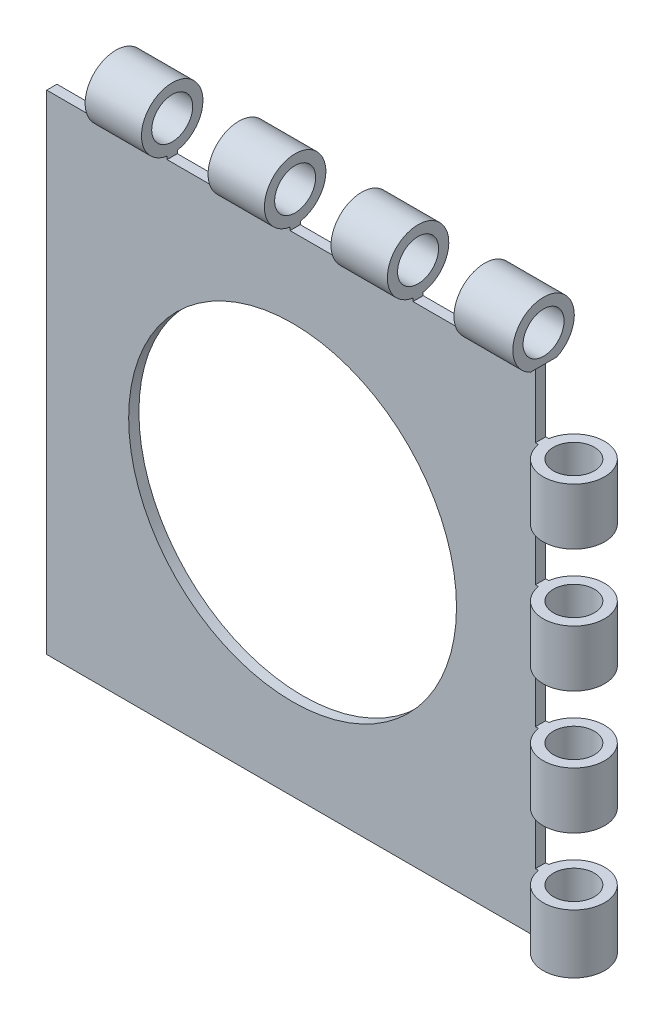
ISO-10303-21;
HEADER;
FILE_DESCRIPTION(('STEP AP214'),'2;1');
FILE_NAME('part.step','',(''),(''),'','','');
FILE_SCHEMA(('AUTOMOTIVE_DESIGN { 1 0 10303 214 1 1 1 1 }'));
ENDSEC;
DATA;
#1=APPLICATION_CONTEXT('core data for automotive mechanical design processes');
#2=APPLICATION_PROTOCOL_DEFINITION('international standard','automotive_design',2000,#1);
#3=PRODUCT_CONTEXT('',#1,'mechanical');
#4=PRODUCT('Part','Part','',(#3));
#5=PRODUCT_RELATED_PRODUCT_CATEGORY('part','',(#4));
#6=PRODUCT_DEFINITION_FORMATION('','',#4);
#7=PRODUCT_DEFINITION_CONTEXT('part definition',#1,'design');
#8=PRODUCT_DEFINITION('design','',#6,#7);
#9=PRODUCT_DEFINITION_SHAPE('','',#8);
#10=(LENGTH_UNIT() NAMED_UNIT(*) SI_UNIT(.MILLI.,.METRE.));
#11=(NAMED_UNIT(*) PLANE_ANGLE_UNIT() SI_UNIT($,.RADIAN.));
#12=(NAMED_UNIT(*) SI_UNIT($,.STERADIAN.) SOLID_ANGLE_UNIT());
#13=UNCERTAINTY_MEASURE_WITH_UNIT(LENGTH_MEASURE(1.E-05),#10,'distance_accuracy_value','');
#14=(GEOMETRIC_REPRESENTATION_CONTEXT(3) GLOBAL_UNCERTAINTY_ASSIGNED_CONTEXT((#13)) GLOBAL_UNIT_ASSIGNED_CONTEXT((#10,
#11,#12)) REPRESENTATION_CONTEXT('',''));
#15=CARTESIAN_POINT('',(0.,0.,0.));
#16=DIRECTION('',(0.,0.,1.));
#17=DIRECTION('',(1.,0.,0.));
#18=AXIS2_PLACEMENT_3D('',#15,#16,#17);
#19=CARTESIAN_POINT('',(76.2000000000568,80.8958883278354,0.79375000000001));
#20=DIRECTION('',(-1.,0.,0.));
#21=DIRECTION('',(0.,0.,1.));
#22=AXIS2_PLACEMENT_3D('',#19,#20,#21);
#23=CYLINDRICAL_SURFACE('',#22,4.7625);
#24=DIRECTION('',(-1.,0.,0.));
#25=VECTOR('',#24,1.);
#26=CARTESIAN_POINT('',(76.2,76.2,1.5875));
#27=LINE('',#26,#25);
#28=CARTESIAN_POINT('',(56.7531250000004,76.2,1.5875));
#29=VERTEX_POINT('',#28);
#30=CARTESIAN_POINT('',(48.0218750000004,76.2,1.5875));
#31=VERTEX_POINT('',#30);
#32=EDGE_CURVE('E345',#29,#31,#27,.T.);
#33=ORIENTED_EDGE('',*,*,#32,.F.);
#34=CARTESIAN_POINT('',(56.7531250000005,80.8958883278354,0.79375000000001));
#35=DIRECTION('',(1.,0.,0.));
#36=DIRECTION('',(0.,1.,0.));
#37=AXIS2_PLACEMENT_3D('',#34,#35,#36);
#38=CIRCLE('',#37,4.7625);
#39=CARTESIAN_POINT('',(56.7531250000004,76.2,0.));
#40=VERTEX_POINT('',#39);
#41=EDGE_CURVE('E542',#29,#40,#38,.F.);
#42=ORIENTED_EDGE('',*,*,#41,.T.);
#43=DIRECTION('',(-1.,0.,0.));
#44=VECTOR('',#43,1.);
#45=CARTESIAN_POINT('',(76.2,76.2,0.));
#46=LINE('',#45,#44);
#47=CARTESIAN_POINT('',(48.0218750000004,76.2,0.));
#48=VERTEX_POINT('',#47);
#49=EDGE_CURVE('E51',#40,#48,#46,.T.);
#50=ORIENTED_EDGE('',*,*,#49,.T.);
#51=CARTESIAN_POINT('',(48.0218750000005,80.8958883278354,0.79375000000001));
#52=DIRECTION('',(-1.,0.,0.));
#53=DIRECTION('',(0.,-1.,0.));
#54=AXIS2_PLACEMENT_3D('',#51,#52,#53);
#55=CIRCLE('',#54,4.7625);
#56=EDGE_CURVE('E528',#48,#31,#55,.F.);
#57=ORIENTED_EDGE('',*,*,#56,.T.);
#58=EDGE_LOOP('',(#33,#42,#50,#57));
#59=FACE_BOUND('',#58,.T.);
#60=ADVANCED_FACE('F28',(#59),#23,.T.);
#61=CARTESIAN_POINT('',(67.0718750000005,80.8958883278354,0.79375000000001));
#62=DIRECTION('',(-1.,0.,0.));
#63=DIRECTION('',(0.,-1.,0.));
#64=AXIS2_PLACEMENT_3D('',#61,#62,#63);
#65=CIRCLE('',#64,4.7625);
#66=CARTESIAN_POINT('',(67.0718750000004,76.2,0.));
#67=VERTEX_POINT('',#66);
#68=CARTESIAN_POINT('',(67.0718750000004,76.2,1.5875));
#69=VERTEX_POINT('',#68);
#70=EDGE_CURVE('E43',#67,#69,#65,.F.);
#71=ORIENTED_EDGE('',*,*,#70,.T.);
#72=CARTESIAN_POINT('',(75.7365133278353,76.2,1.5875));
#73=VERTEX_POINT('',#72);
#74=EDGE_CURVE('E342',#73,#69,#27,.T.);
#75=ORIENTED_EDGE('',*,*,#74,.F.);
#76=CARTESIAN_POINT('',(75.7365133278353,80.8958883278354,0.79375000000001));
#77=DIRECTION('',(-1.,0.,0.));
#78=DIRECTION('',(0.,0.,1.));
#79=AXIS2_PLACEMENT_3D('',#76,#77,#78);
#80=CIRCLE('',#79,4.7625);
#81=CARTESIAN_POINT('',(75.7365133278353,76.596875,2.84311347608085));
#82=VERTEX_POINT('',#81);
#83=EDGE_CURVE('E317',#82,#73,#80,.F.);
#84=ORIENTED_EDGE('',*,*,#83,.F.);
#85=DIRECTION('',(-1.,0.,0.));
#86=VECTOR('',#85,1.);
#87=CARTESIAN_POINT('',(76.2000000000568,76.596875,2.84311347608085));
#88=LINE('',#87,#86);
#89=CARTESIAN_POINT('',(76.2000000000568,76.596875,2.84311347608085));
#90=VERTEX_POINT('',#89);
#91=EDGE_CURVE('E382',#82,#90,#88,.F.);
#92=ORIENTED_EDGE('',*,*,#91,.T.);
#93=CARTESIAN_POINT('',(76.2000000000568,80.8958883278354,0.79375000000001));
#94=DIRECTION('',(-1.,0.,0.));
#95=DIRECTION('',(0.,0.,1.));
#96=AXIS2_PLACEMENT_3D('',#93,#94,#95);
#97=CIRCLE('',#96,4.7625);
#98=CARTESIAN_POINT('',(76.2000000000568,76.596875,-1.25561347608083));
#99=VERTEX_POINT('',#98);
#100=EDGE_CURVE('E367',#90,#99,#97,.T.);
#101=ORIENTED_EDGE('',*,*,#100,.T.);
#102=DIRECTION('',(-1.,0.,0.));
#103=VECTOR('',#102,1.);
#104=CARTESIAN_POINT('',(76.2000000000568,76.596875,-1.25561347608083));
#105=LINE('',#104,#103);
#106=CARTESIAN_POINT('',(75.7365133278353,76.596875,-1.25561347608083));
#107=VERTEX_POINT('',#106);
#108=EDGE_CURVE('E385',#99,#107,#105,.T.);
#109=ORIENTED_EDGE('',*,*,#108,.T.);
#110=CARTESIAN_POINT('',(75.7365133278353,76.2,0.));
#111=VERTEX_POINT('',#110);
#112=EDGE_CURVE('E318',#111,#107,#80,.F.);
#113=ORIENTED_EDGE('',*,*,#112,.F.);
#114=EDGE_CURVE('E358',#111,#67,#46,.T.);
#115=ORIENTED_EDGE('',*,*,#114,.T.);
#116=EDGE_LOOP('',(#71,#75,#84,#92,#101,#109,#113,#115));
#117=FACE_BOUND('',#116,.T.);
#118=ADVANCED_FACE('F559',(#117),#23,.T.);
#119=CARTESIAN_POINT('',(85.6583883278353,80.8958883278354,0.79375000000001));
#120=DIRECTION('',(-1.,0.,0.));
#121=DIRECTION('',(0.,0.,1.));
#122=AXIS2_PLACEMENT_3D('',#119,#120,#121);
#123=CYLINDRICAL_SURFACE('',#122,3.175);
#124=CARTESIAN_POINT('',(48.0218750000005,80.8958883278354,0.79375000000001));
#125=DIRECTION('',(-1.,0.,0.));
#126=DIRECTION('',(0.,-1.,0.));
#127=AXIS2_PLACEMENT_3D('',#124,#125,#126);
#128=CIRCLE('',#127,3.175);
#129=CARTESIAN_POINT('',(48.0218750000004,77.7208883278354,0.79375000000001));
#130=VERTEX_POINT('',#129);
#131=EDGE_CURVE('E522',#130,#130,#128,.F.);
#132=ORIENTED_EDGE('',*,*,#131,.F.);
#133=EDGE_LOOP('',(#132));
#134=FACE_BOUND('',#133,.T.);
#135=CARTESIAN_POINT('',(56.7531250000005,80.8958883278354,0.79375000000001));
#136=DIRECTION('',(1.,0.,0.));
#137=DIRECTION('',(0.,1.,0.));
#138=AXIS2_PLACEMENT_3D('',#135,#136,#137);
#139=CIRCLE('',#138,3.175);
#140=CARTESIAN_POINT('',(56.7531250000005,84.0708883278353,0.79375000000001));
#141=VERTEX_POINT('',#140);
#142=EDGE_CURVE('E537',#141,#141,#139,.F.);
#143=ORIENTED_EDGE('',*,*,#142,.F.);
#144=EDGE_LOOP('',(#143));
#145=FACE_BOUND('',#144,.T.);
#146=ADVANCED_FACE('F654',(#134,#145),#123,.F.);
#147=CARTESIAN_POINT('',(76.2000000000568,80.8958883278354,0.79375000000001));
#148=DIRECTION('',(-1.,0.,0.));
#149=DIRECTION('',(0.,0.,1.));
#150=AXIS2_PLACEMENT_3D('',#147,#148,#149);
#151=CIRCLE('',#150,3.175);
#152=CARTESIAN_POINT('',(76.2000000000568,80.8958883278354,3.96875000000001));
#153=VERTEX_POINT('',#152);
#154=EDGE_CURVE('E328',#153,#153,#151,.T.);
#155=ORIENTED_EDGE('',*,*,#154,.F.);
#156=EDGE_LOOP('',(#155));
#157=FACE_BOUND('',#156,.T.);
#158=CARTESIAN_POINT('',(67.0718750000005,80.8958883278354,0.79375000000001));
#159=DIRECTION('',(-1.,0.,0.));
#160=DIRECTION('',(0.,-1.,0.));
#161=AXIS2_PLACEMENT_3D('',#158,#159,#160);
#162=CIRCLE('',#161,3.175);
#163=CARTESIAN_POINT('',(67.0718750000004,77.7208883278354,0.79375000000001));
#164=VERTEX_POINT('',#163);
#165=EDGE_CURVE('E544',#164,#164,#162,.F.);
#166=ORIENTED_EDGE('',*,*,#165,.F.);
#167=EDGE_LOOP('',(#166));
#168=FACE_BOUND('',#167,.T.);
#169=ADVANCED_FACE('F668',(#157,#168),#123,.F.);
#170=CARTESIAN_POINT('',(0.,0.,1.5875));
#171=DIRECTION('',(0.,0.,-1.));
#172=DIRECTION('',(-1.,0.,0.));
#173=AXIS2_PLACEMENT_3D('',#170,#171,#172);
#174=PLANE('',#173);
#175=CARTESIAN_POINT('',(38.1000000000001,38.1,1.5875));
#176=DIRECTION('',(0.,0.,-1.));
#177=DIRECTION('',(-1.,0.,0.));
#178=AXIS2_PLACEMENT_3D('',#175,#176,#177);
#179=CIRCLE('',#178,25.4);
#180=CARTESIAN_POINT('',(12.7000000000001,38.1,1.5875));
#181=VERTEX_POINT('',#180);
#182=EDGE_CURVE('E370',#181,#181,#179,.T.);
#183=ORIENTED_EDGE('',*,*,#182,.T.);
#184=EDGE_LOOP('',(#183));
#185=FACE_BOUND('',#184,.T.);
#186=DIRECTION('',(0.,-1.,0.));
#187=VECTOR('',#186,1.);
#188=CARTESIAN_POINT('',(56.7531249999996,-5.94457774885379E-13,1.5875));
#189=LINE('',#188,#187);
#190=CARTESIAN_POINT('',(56.7531250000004,75.7365133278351,1.5875));
#191=VERTEX_POINT('',#190);
#192=EDGE_CURVE('E540',#29,#191,#189,.T.);
#193=ORIENTED_EDGE('',*,*,#192,.F.);
#194=ORIENTED_EDGE('',*,*,#32,.T.);
#195=DIRECTION('',(0.,1.,0.));
#196=VECTOR('',#195,1.);
#197=CARTESIAN_POINT('',(48.0218749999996,-5.0300273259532E-13,1.5875));
#198=LINE('',#197,#196);
#199=CARTESIAN_POINT('',(48.0218750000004,75.7365133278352,1.5875));
#200=VERTEX_POINT('',#199);
#201=EDGE_CURVE('E525',#200,#31,#198,.T.);
#202=ORIENTED_EDGE('',*,*,#201,.F.);
#203=DIRECTION('',(-1.,0.,0.));
#204=VECTOR('',#203,1.);
#205=CARTESIAN_POINT('',(7.93298328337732E-13,75.7365133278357,1.5875));
#206=LINE('',#205,#204);
#207=CARTESIAN_POINT('',(37.7031250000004,75.7365133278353,1.5875));
#208=VERTEX_POINT('',#207);
#209=EDGE_CURVE('E510',#200,#208,#206,.T.);
#210=ORIENTED_EDGE('',*,*,#209,.T.);
#211=DIRECTION('',(0.,-1.,0.));
#212=VECTOR('',#211,1.);
#213=CARTESIAN_POINT('',(37.7031249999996,-3.94919500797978E-13,1.5875));
#214=LINE('',#213,#212);
#215=CARTESIAN_POINT('',(37.7031250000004,76.2,1.5875));
#216=VERTEX_POINT('',#215);
#217=EDGE_CURVE('E518',#216,#208,#214,.T.);
#218=ORIENTED_EDGE('',*,*,#217,.F.);
#219=CARTESIAN_POINT('',(28.9718750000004,76.2,1.5875));
#220=VERTEX_POINT('',#219);
#221=EDGE_CURVE('E623',#216,#220,#27,.T.);
#222=ORIENTED_EDGE('',*,*,#221,.T.);
#223=DIRECTION('',(0.,1.,0.));
#224=VECTOR('',#223,1.);
#225=CARTESIAN_POINT('',(28.9718749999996,-3.03464458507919E-13,1.5875));
#226=LINE('',#225,#224);
#227=CARTESIAN_POINT('',(28.9718750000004,75.7365133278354,1.5875));
#228=VERTEX_POINT('',#227);
#229=EDGE_CURVE('E500',#228,#220,#226,.T.);
#230=ORIENTED_EDGE('',*,*,#229,.F.);
#231=DIRECTION('',(-1.,0.,0.));
#232=VECTOR('',#231,1.);
#233=CARTESIAN_POINT('',(7.93298328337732E-13,75.7365133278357,1.5875));
#234=LINE('',#233,#232);
#235=CARTESIAN_POINT('',(18.6531250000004,75.7365133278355,1.5875));
#236=VERTEX_POINT('',#235);
#237=EDGE_CURVE('E487',#228,#236,#234,.T.);
#238=ORIENTED_EDGE('',*,*,#237,.T.);
#239=DIRECTION('',(0.,-1.,0.));
#240=VECTOR('',#239,1.);
#241=CARTESIAN_POINT('',(18.6531249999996,-1.95381226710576E-13,1.5875));
#242=LINE('',#241,#240);
#243=CARTESIAN_POINT('',(18.6531250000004,76.2,1.5875));
#244=VERTEX_POINT('',#243);
#245=EDGE_CURVE('E493',#244,#236,#242,.T.);
#246=ORIENTED_EDGE('',*,*,#245,.F.);
#247=CARTESIAN_POINT('',(9.92187500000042,76.2,1.5875));
#248=VERTEX_POINT('',#247);
#249=EDGE_CURVE('E346',#244,#248,#27,.T.);
#250=ORIENTED_EDGE('',*,*,#249,.T.);
#251=DIRECTION('',(0.,1.,0.));
#252=VECTOR('',#251,1.);
#253=CARTESIAN_POINT('',(9.92187499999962,-1.03926184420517E-13,1.5875));
#254=LINE('',#253,#252);
#255=CARTESIAN_POINT('',(9.92187500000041,75.7365133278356,1.5875));
#256=VERTEX_POINT('',#255);
#257=EDGE_CURVE('E477',#256,#248,#254,.T.);
#258=ORIENTED_EDGE('',*,*,#257,.F.);
#259=DIRECTION('',(-1.,0.,0.));
#260=VECTOR('',#259,1.);
#261=CARTESIAN_POINT('',(7.93298328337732E-13,75.7365133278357,1.5875));
#262=LINE('',#261,#260);
#263=CARTESIAN_POINT('',(0.,75.7365133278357,1.5875));
#264=VERTEX_POINT('',#263);
#265=EDGE_CURVE('E470',#256,#264,#262,.T.);
#266=ORIENTED_EDGE('',*,*,#265,.T.);
#267=DIRECTION('',(0.,1.,0.));
#268=VECTOR('',#267,1.);
#269=CARTESIAN_POINT('',(0.,0.,1.5875));
#270=LINE('',#269,#268);
#271=CARTESIAN_POINT('',(0.,0.,1.5875));
#272=VERTEX_POINT('',#271);
#273=EDGE_CURVE('E347',#272,#264,#270,.T.);
#274=ORIENTED_EDGE('',*,*,#273,.F.);
#275=DIRECTION('',(1.,0.,0.));
#276=VECTOR('',#275,1.);
#277=CARTESIAN_POINT('',(0.,0.,1.5875));
#278=LINE('',#277,#276);
#279=CARTESIAN_POINT('',(76.2,0.,1.5875));
#280=VERTEX_POINT('',#279);
#281=EDGE_CURVE('E334',#272,#280,#278,.T.);
#282=ORIENTED_EDGE('',*,*,#281,.T.);
#283=DIRECTION('',(0.,-1.,0.));
#284=VECTOR('',#283,1.);
#285=CARTESIAN_POINT('',(76.2,76.2,1.5875));
#286=LINE('',#285,#284);
#287=CARTESIAN_POINT('',(76.2,9.12812500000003,1.5875));
#288=VERTEX_POINT('',#287);
#289=EDGE_CURVE('E341',#288,#280,#286,.T.);
#290=ORIENTED_EDGE('',*,*,#289,.F.);
#291=DIRECTION('',(1.,0.,0.));
#292=VECTOR('',#291,1.);
#293=CARTESIAN_POINT('',(0.,9.12812500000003,1.5875));
#294=LINE('',#293,#292);
#295=CARTESIAN_POINT('',(75.7365133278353,9.12812500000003,1.5875));
#296=VERTEX_POINT('',#295);
#297=EDGE_CURVE('E461',#296,#288,#294,.T.);
#298=ORIENTED_EDGE('',*,*,#297,.F.);
#299=DIRECTION('',(0.,1.,0.));
#300=VECTOR('',#299,1.);
#301=CARTESIAN_POINT('',(75.7365133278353,0.,1.5875));
#302=LINE('',#301,#300);
#303=CARTESIAN_POINT('',(75.7365133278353,19.446875,1.5875));
#304=VERTEX_POINT('',#303);
#305=EDGE_CURVE('E446',#296,#304,#302,.T.);
#306=ORIENTED_EDGE('',*,*,#305,.T.);
#307=DIRECTION('',(-1.,0.,0.));
#308=VECTOR('',#307,1.);
#309=CARTESIAN_POINT('',(0.,19.446875,1.5875));
#310=LINE('',#309,#308);
#311=CARTESIAN_POINT('',(76.2,19.446875,1.5875));
#312=VERTEX_POINT('',#311);
#313=EDGE_CURVE('E454',#312,#304,#310,.T.);
#314=ORIENTED_EDGE('',*,*,#313,.F.);
#315=CARTESIAN_POINT('',(76.2,28.178125,1.5875));
#316=VERTEX_POINT('',#315);
#317=EDGE_CURVE('E1000',#316,#312,#286,.T.);
#318=ORIENTED_EDGE('',*,*,#317,.F.);
#319=DIRECTION('',(1.,0.,0.));
#320=VECTOR('',#319,1.);
#321=CARTESIAN_POINT('',(0.,28.178125,1.5875));
#322=LINE('',#321,#320);
#323=CARTESIAN_POINT('',(75.7365133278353,28.178125,1.5875));
#324=VERTEX_POINT('',#323);
#325=EDGE_CURVE('E437',#324,#316,#322,.T.);
#326=ORIENTED_EDGE('',*,*,#325,.F.);
#327=DIRECTION('',(0.,1.,0.));
#328=VECTOR('',#327,1.);
#329=CARTESIAN_POINT('',(75.7365133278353,0.,1.5875));
#330=LINE('',#329,#328);
#331=CARTESIAN_POINT('',(75.7365133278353,38.496875,1.5875));
#332=VERTEX_POINT('',#331);
#333=EDGE_CURVE('E422',#324,#332,#330,.T.);
#334=ORIENTED_EDGE('',*,*,#333,.T.);
#335=DIRECTION('',(-1.,0.,0.));
#336=VECTOR('',#335,1.);
#337=CARTESIAN_POINT('',(0.,38.496875,1.5875));
#338=LINE('',#337,#336);
#339=CARTESIAN_POINT('',(76.2,38.496875,1.5875));
#340=VERTEX_POINT('',#339);
#341=EDGE_CURVE('E430',#340,#332,#338,.T.);
#342=ORIENTED_EDGE('',*,*,#341,.F.);
#343=CARTESIAN_POINT('',(76.2,47.228125,1.5875));
#344=VERTEX_POINT('',#343);
#345=EDGE_CURVE('E340',#344,#340,#286,.T.);
#346=ORIENTED_EDGE('',*,*,#345,.F.);
#347=DIRECTION('',(1.,0.,0.));
#348=VECTOR('',#347,1.);
#349=CARTESIAN_POINT('',(0.,47.228125,1.5875));
#350=LINE('',#349,#348);
#351=CARTESIAN_POINT('',(75.7365133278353,47.228125,1.5875));
#352=VERTEX_POINT('',#351);
#353=EDGE_CURVE('E413',#352,#344,#350,.T.);
#354=ORIENTED_EDGE('',*,*,#353,.F.);
#355=DIRECTION('',(0.,1.,0.));
#356=VECTOR('',#355,1.);
#357=CARTESIAN_POINT('',(75.7365133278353,0.,1.5875));
#358=LINE('',#357,#356);
#359=CARTESIAN_POINT('',(75.7365133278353,57.546875,1.5875));
#360=VERTEX_POINT('',#359);
#361=EDGE_CURVE('E398',#352,#360,#358,.T.);
#362=ORIENTED_EDGE('',*,*,#361,.T.);
#363=DIRECTION('',(-1.,0.,0.));
#364=VECTOR('',#363,1.);
#365=CARTESIAN_POINT('',(0.,57.546875,1.5875));
#366=LINE('',#365,#364);
#367=CARTESIAN_POINT('',(76.2,57.546875,1.5875));
#368=VERTEX_POINT('',#367);
#369=EDGE_CURVE('E406',#368,#360,#366,.T.);
#370=ORIENTED_EDGE('',*,*,#369,.F.);
#371=CARTESIAN_POINT('',(76.2,66.278125,1.5875));
#372=VERTEX_POINT('',#371);
#373=EDGE_CURVE('E337',#372,#368,#286,.T.);
#374=ORIENTED_EDGE('',*,*,#373,.F.);
#375=DIRECTION('',(1.,0.,0.));
#376=VECTOR('',#375,1.);
#377=CARTESIAN_POINT('',(0.,66.278125,1.5875));
#378=LINE('',#377,#376);
#379=CARTESIAN_POINT('',(75.7365133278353,66.278125,1.5875));
#380=VERTEX_POINT('',#379);
#381=EDGE_CURVE('E388',#380,#372,#378,.T.);
#382=ORIENTED_EDGE('',*,*,#381,.F.);
#383=DIRECTION('',(0.,1.,0.));
#384=VECTOR('',#383,1.);
#385=CARTESIAN_POINT('',(75.7365133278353,0.,1.5875));
#386=LINE('',#385,#384);
#387=EDGE_CURVE('E332',#380,#73,#386,.T.);
#388=ORIENTED_EDGE('',*,*,#387,.T.);
#389=ORIENTED_EDGE('',*,*,#74,.T.);
#390=DIRECTION('',(0.,1.,0.));
#391=VECTOR('',#390,1.);
#392=CARTESIAN_POINT('',(67.0718749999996,-7.02541006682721E-13,1.5875));
#393=LINE('',#392,#391);
#394=CARTESIAN_POINT('',(67.0718750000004,75.736513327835,1.5875));
#395=VERTEX_POINT('',#394);
#396=EDGE_CURVE('E547',#395,#69,#393,.T.);
#397=ORIENTED_EDGE('',*,*,#396,.F.);
#398=DIRECTION('',(-1.,0.,0.));
#399=VECTOR('',#398,1.);
#400=CARTESIAN_POINT('',(7.93298328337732E-13,75.7365133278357,1.5875));
#401=LINE('',#400,#399);
#402=EDGE_CURVE('E265',#395,#191,#401,.T.);
#403=ORIENTED_EDGE('',*,*,#402,.T.);
#404=EDGE_LOOP('',(#193,#194,#202,#210,#218,#222,#230,#238,#246,#250,#258,#266,#274,#282,#290,
#298,#306,#314,#318,#326,#334,#342,#346,#354,#362,#370,#374,#382,#388,#389,#397,#403));
#405=FACE_BOUND('',#404,.T.);
#406=ADVANCED_FACE('F553',(#185,#405),#174,.F.);
#407=CARTESIAN_POINT('',(0.,0.,0.));
#408=DIRECTION('',(0.,0.,-1.));
#409=DIRECTION('',(-1.,0.,0.));
#410=AXIS2_PLACEMENT_3D('',#407,#408,#409);
#411=PLANE('',#410);
#412=CARTESIAN_POINT('',(38.1000000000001,38.1,0.));
#413=DIRECTION('',(0.,0.,-1.));
#414=DIRECTION('',(-1.,0.,0.));
#415=AXIS2_PLACEMENT_3D('',#412,#413,#414);
#416=CIRCLE('',#415,25.4);
#417=CARTESIAN_POINT('',(12.7000000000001,38.1,0.));
#418=VERTEX_POINT('',#417);
#419=EDGE_CURVE('E373',#418,#418,#416,.T.);
#420=ORIENTED_EDGE('',*,*,#419,.F.);
#421=EDGE_LOOP('',(#420));
#422=FACE_BOUND('',#421,.T.);
#423=ORIENTED_EDGE('',*,*,#49,.F.);
#424=DIRECTION('',(0.,-1.,0.));
#425=VECTOR('',#424,1.);
#426=CARTESIAN_POINT('',(56.7531249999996,-5.94457774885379E-13,0.));
#427=LINE('',#426,#425);
#428=CARTESIAN_POINT('',(56.7531250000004,75.7365133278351,0.));
#429=VERTEX_POINT('',#428);
#430=EDGE_CURVE('E11',#40,#429,#427,.T.);
#431=ORIENTED_EDGE('',*,*,#430,.T.);
#432=DIRECTION('',(-1.,0.,0.));
#433=VECTOR('',#432,1.);
#434=CARTESIAN_POINT('',(7.93298328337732E-13,75.7365133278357,0.));
#435=LINE('',#434,#433);
#436=CARTESIAN_POINT('',(67.0718750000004,75.736513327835,0.));
#437=VERTEX_POINT('',#436);
#438=EDGE_CURVE('E36',#437,#429,#435,.T.);
#439=ORIENTED_EDGE('',*,*,#438,.F.);
#440=DIRECTION('',(0.,1.,0.));
#441=VECTOR('',#440,1.);
#442=CARTESIAN_POINT('',(67.0718749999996,-7.02541006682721E-13,0.));
#443=LINE('',#442,#441);
#444=EDGE_CURVE('E248',#437,#67,#443,.T.);
#445=ORIENTED_EDGE('',*,*,#444,.T.);
#446=ORIENTED_EDGE('',*,*,#114,.F.);
#447=DIRECTION('',(0.,1.,0.));
#448=VECTOR('',#447,1.);
#449=CARTESIAN_POINT('',(75.7365133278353,0.,0.));
#450=LINE('',#449,#448);
#451=CARTESIAN_POINT('',(75.7365133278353,66.278125,0.));
#452=VERTEX_POINT('',#451);
#453=EDGE_CURVE('E380',#452,#111,#450,.T.);
#454=ORIENTED_EDGE('',*,*,#453,.F.);
#455=DIRECTION('',(1.,0.,0.));
#456=VECTOR('',#455,1.);
#457=CARTESIAN_POINT('',(0.,66.278125,0.));
#458=LINE('',#457,#456);
#459=CARTESIAN_POINT('',(76.2,66.278125,0.));
#460=VERTEX_POINT('',#459);
#461=EDGE_CURVE('E391',#452,#460,#458,.T.);
#462=ORIENTED_EDGE('',*,*,#461,.T.);
#463=DIRECTION('',(0.,-1.,0.));
#464=VECTOR('',#463,1.);
#465=CARTESIAN_POINT('',(76.2,76.2,0.));
#466=LINE('',#465,#464);
#467=CARTESIAN_POINT('',(76.2,57.546875,0.));
#468=VERTEX_POINT('',#467);
#469=EDGE_CURVE('E353',#460,#468,#466,.T.);
#470=ORIENTED_EDGE('',*,*,#469,.T.);
#471=DIRECTION('',(-1.,0.,0.));
#472=VECTOR('',#471,1.);
#473=CARTESIAN_POINT('',(0.,57.546875,0.));
#474=LINE('',#473,#472);
#475=CARTESIAN_POINT('',(75.7365133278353,57.546875,0.));
#476=VERTEX_POINT('',#475);
#477=EDGE_CURVE('E309',#468,#476,#474,.T.);
#478=ORIENTED_EDGE('',*,*,#477,.T.);
#479=DIRECTION('',(0.,1.,0.));
#480=VECTOR('',#479,1.);
#481=CARTESIAN_POINT('',(75.7365133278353,0.,0.));
#482=LINE('',#481,#480);
#483=CARTESIAN_POINT('',(75.7365133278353,47.228125,0.));
#484=VERTEX_POINT('',#483);
#485=EDGE_CURVE('E312',#484,#476,#482,.T.);
#486=ORIENTED_EDGE('',*,*,#485,.F.);
#487=DIRECTION('',(1.,0.,0.));
#488=VECTOR('',#487,1.);
#489=CARTESIAN_POINT('',(0.,47.228125,0.));
#490=LINE('',#489,#488);
#491=CARTESIAN_POINT('',(76.2,47.228125,0.));
#492=VERTEX_POINT('',#491);
#493=EDGE_CURVE('E314',#484,#492,#490,.T.);
#494=ORIENTED_EDGE('',*,*,#493,.T.);
#495=CARTESIAN_POINT('',(76.2,38.496875,0.));
#496=VERTEX_POINT('',#495);
#497=EDGE_CURVE('E356',#492,#496,#466,.T.);
#498=ORIENTED_EDGE('',*,*,#497,.T.);
#499=DIRECTION('',(-1.,0.,0.));
#500=VECTOR('',#499,1.);
#501=CARTESIAN_POINT('',(0.,38.496875,0.));
#502=LINE('',#501,#500);
#503=CARTESIAN_POINT('',(75.7365133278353,38.496875,0.));
#504=VERTEX_POINT('',#503);
#505=EDGE_CURVE('E301',#496,#504,#502,.T.);
#506=ORIENTED_EDGE('',*,*,#505,.T.);
#507=DIRECTION('',(0.,1.,0.));
#508=VECTOR('',#507,1.);
#509=CARTESIAN_POINT('',(75.7365133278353,0.,0.));
#510=LINE('',#509,#508);
#511=CARTESIAN_POINT('',(75.7365133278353,28.178125,0.));
#512=VERTEX_POINT('',#511);
#513=EDGE_CURVE('E304',#512,#504,#510,.T.);
#514=ORIENTED_EDGE('',*,*,#513,.F.);
#515=DIRECTION('',(1.,0.,0.));
#516=VECTOR('',#515,1.);
#517=CARTESIAN_POINT('',(0.,28.178125,0.));
#518=LINE('',#517,#516);
#519=CARTESIAN_POINT('',(76.2,28.178125,0.));
#520=VERTEX_POINT('',#519);
#521=EDGE_CURVE('E306',#512,#520,#518,.T.);
#522=ORIENTED_EDGE('',*,*,#521,.T.);
#523=CARTESIAN_POINT('',(76.2,19.446875,0.));
#524=VERTEX_POINT('',#523);
#525=EDGE_CURVE('E594',#520,#524,#466,.T.);
#526=ORIENTED_EDGE('',*,*,#525,.T.);
#527=DIRECTION('',(-1.,0.,0.));
#528=VECTOR('',#527,1.);
#529=CARTESIAN_POINT('',(0.,19.446875,0.));
#530=LINE('',#529,#528);
#531=CARTESIAN_POINT('',(75.7365133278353,19.446875,0.));
#532=VERTEX_POINT('',#531);
#533=EDGE_CURVE('E288',#524,#532,#530,.T.);
#534=ORIENTED_EDGE('',*,*,#533,.T.);
#535=DIRECTION('',(0.,1.,0.));
#536=VECTOR('',#535,1.);
#537=CARTESIAN_POINT('',(75.7365133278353,0.,0.));
#538=LINE('',#537,#536);
#539=CARTESIAN_POINT('',(75.7365133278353,9.12812500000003,0.));
#540=VERTEX_POINT('',#539);
#541=EDGE_CURVE('E296',#540,#532,#538,.T.);
#542=ORIENTED_EDGE('',*,*,#541,.F.);
#543=DIRECTION('',(1.,0.,0.));
#544=VECTOR('',#543,1.);
#545=CARTESIAN_POINT('',(0.,9.12812500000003,0.));
#546=LINE('',#545,#544);
#547=CARTESIAN_POINT('',(76.2,9.12812500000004,0.));
#548=VERTEX_POINT('',#547);
#549=EDGE_CURVE('E298',#540,#548,#546,.T.);
#550=ORIENTED_EDGE('',*,*,#549,.T.);
#551=CARTESIAN_POINT('',(76.2,0.,0.));
#552=VERTEX_POINT('',#551);
#553=EDGE_CURVE('E357',#548,#552,#466,.T.);
#554=ORIENTED_EDGE('',*,*,#553,.T.);
#555=DIRECTION('',(1.,0.,0.));
#556=VECTOR('',#555,1.);
#557=CARTESIAN_POINT('',(0.,0.,0.));
#558=LINE('',#557,#556);
#559=CARTESIAN_POINT('',(0.,0.,0.));
#560=VERTEX_POINT('',#559);
#561=EDGE_CURVE('E350',#560,#552,#558,.T.);
#562=ORIENTED_EDGE('',*,*,#561,.F.);
#563=DIRECTION('',(0.,1.,0.));
#564=VECTOR('',#563,1.);
#565=CARTESIAN_POINT('',(0.,0.,0.));
#566=LINE('',#565,#564);
#567=CARTESIAN_POINT('',(0.,75.7365133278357,0.));
#568=VERTEX_POINT('',#567);
#569=EDGE_CURVE('E361',#560,#568,#566,.T.);
#570=ORIENTED_EDGE('',*,*,#569,.T.);
#571=DIRECTION('',(-1.,0.,0.));
#572=VECTOR('',#571,1.);
#573=CARTESIAN_POINT('',(7.93298328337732E-13,75.7365133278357,0.));
#574=LINE('',#573,#572);
#575=CARTESIAN_POINT('',(9.92187500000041,75.7365133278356,0.));
#576=VERTEX_POINT('',#575);
#577=EDGE_CURVE('E475',#576,#568,#574,.T.);
#578=ORIENTED_EDGE('',*,*,#577,.F.);
#579=DIRECTION('',(0.,1.,0.));
#580=VECTOR('',#579,1.);
#581=CARTESIAN_POINT('',(9.92187499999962,-1.03926184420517E-13,0.));
#582=LINE('',#581,#580);
#583=CARTESIAN_POINT('',(9.92187500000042,76.2,0.));
#584=VERTEX_POINT('',#583);
#585=EDGE_CURVE('E480',#576,#584,#582,.T.);
#586=ORIENTED_EDGE('',*,*,#585,.T.);
#587=CARTESIAN_POINT('',(18.6531250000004,76.2,0.));
#588=VERTEX_POINT('',#587);
#589=EDGE_CURVE('E360',#588,#584,#46,.T.);
#590=ORIENTED_EDGE('',*,*,#589,.F.);
#591=DIRECTION('',(0.,-1.,0.));
#592=VECTOR('',#591,1.);
#593=CARTESIAN_POINT('',(18.6531249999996,-1.95381226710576E-13,0.));
#594=LINE('',#593,#592);
#595=CARTESIAN_POINT('',(18.6531250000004,75.7365133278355,0.));
#596=VERTEX_POINT('',#595);
#597=EDGE_CURVE('E278',#588,#596,#594,.T.);
#598=ORIENTED_EDGE('',*,*,#597,.T.);
#599=DIRECTION('',(-1.,0.,0.));
#600=VECTOR('',#599,1.);
#601=CARTESIAN_POINT('',(7.93298328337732E-13,75.7365133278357,0.));
#602=LINE('',#601,#600);
#603=CARTESIAN_POINT('',(28.9718750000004,75.7365133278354,0.));
#604=VERTEX_POINT('',#603);
#605=EDGE_CURVE('E281',#604,#596,#602,.T.);
#606=ORIENTED_EDGE('',*,*,#605,.F.);
#607=DIRECTION('',(0.,1.,0.));
#608=VECTOR('',#607,1.);
#609=CARTESIAN_POINT('',(28.9718749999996,-3.03464458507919E-13,0.));
#610=LINE('',#609,#608);
#611=CARTESIAN_POINT('',(28.9718750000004,76.2,0.));
#612=VERTEX_POINT('',#611);
#613=EDGE_CURVE('E283',#604,#612,#610,.T.);
#614=ORIENTED_EDGE('',*,*,#613,.T.);
#615=CARTESIAN_POINT('',(37.7031250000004,76.2,0.));
#616=VERTEX_POINT('',#615);
#617=EDGE_CURVE('E626',#616,#612,#46,.T.);
#618=ORIENTED_EDGE('',*,*,#617,.F.);
#619=DIRECTION('',(0.,-1.,0.));
#620=VECTOR('',#619,1.);
#621=CARTESIAN_POINT('',(37.7031249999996,-3.94919500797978E-13,0.));
#622=LINE('',#621,#620);
#623=CARTESIAN_POINT('',(37.7031250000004,75.7365133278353,0.));
#624=VERTEX_POINT('',#623);
#625=EDGE_CURVE('E258',#616,#624,#622,.T.);
#626=ORIENTED_EDGE('',*,*,#625,.T.);
#627=DIRECTION('',(-1.,0.,0.));
#628=VECTOR('',#627,1.);
#629=CARTESIAN_POINT('',(7.93298328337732E-13,75.7365133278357,0.));
#630=LINE('',#629,#628);
#631=CARTESIAN_POINT('',(48.0218750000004,75.7365133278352,0.));
#632=VERTEX_POINT('',#631);
#633=EDGE_CURVE('E273',#632,#624,#630,.T.);
#634=ORIENTED_EDGE('',*,*,#633,.F.);
#635=DIRECTION('',(0.,1.,0.));
#636=VECTOR('',#635,1.);
#637=CARTESIAN_POINT('',(48.0218749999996,-5.0300273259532E-13,0.));
#638=LINE('',#637,#636);
#639=EDGE_CURVE('E275',#632,#48,#638,.T.);
#640=ORIENTED_EDGE('',*,*,#639,.T.);
#641=EDGE_LOOP('',(#423,#431,#439,#445,#446,#454,#462,#470,#478,#486,#494,#498,#506,#514,#522,
#526,#534,#542,#550,#554,#562,#570,#578,#586,#590,#598,#606,#614,#618,#626,#634,#640));
#642=FACE_BOUND('',#641,.T.);
#643=ADVANCED_FACE('F268',(#422,#642),#411,.T.);
#644=ORIENTED_EDGE('',*,*,#221,.F.);
#645=CARTESIAN_POINT('',(37.7031250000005,80.8958883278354,0.79375000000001));
#646=DIRECTION('',(1.,0.,0.));
#647=DIRECTION('',(0.,1.,0.));
#648=AXIS2_PLACEMENT_3D('',#645,#646,#647);
#649=CIRCLE('',#648,4.7625);
#650=EDGE_CURVE('E520',#216,#616,#649,.F.);
#651=ORIENTED_EDGE('',*,*,#650,.T.);
#652=ORIENTED_EDGE('',*,*,#617,.T.);
#653=CARTESIAN_POINT('',(28.9718750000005,80.8958883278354,0.79375000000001));
#654=DIRECTION('',(-1.,0.,0.));
#655=DIRECTION('',(0.,-1.,0.));
#656=AXIS2_PLACEMENT_3D('',#653,#654,#655);
#657=CIRCLE('',#656,4.7625);
#658=EDGE_CURVE('E503',#612,#220,#657,.F.);
#659=ORIENTED_EDGE('',*,*,#658,.T.);
#660=EDGE_LOOP('',(#644,#651,#652,#659));
#661=FACE_BOUND('',#660,.T.);
#662=ADVANCED_FACE('F631',(#661),#23,.T.);
#663=CARTESIAN_POINT('',(28.9718750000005,80.8958883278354,0.79375000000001));
#664=DIRECTION('',(-1.,0.,0.));
#665=DIRECTION('',(0.,-1.,0.));
#666=AXIS2_PLACEMENT_3D('',#663,#664,#665);
#667=CIRCLE('',#666,3.175);
#668=CARTESIAN_POINT('',(28.9718750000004,77.7208883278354,0.79375000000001));
#669=VERTEX_POINT('',#668);
#670=EDGE_CURVE('E497',#669,#669,#667,.F.);
#671=ORIENTED_EDGE('',*,*,#670,.F.);
#672=EDGE_LOOP('',(#671));
#673=FACE_BOUND('',#672,.T.);
#674=CARTESIAN_POINT('',(37.7031250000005,80.8958883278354,0.79375000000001));
#675=DIRECTION('',(1.,0.,0.));
#676=DIRECTION('',(0.,1.,0.));
#677=AXIS2_PLACEMENT_3D('',#674,#675,#676);
#678=CIRCLE('',#677,3.175);
#679=CARTESIAN_POINT('',(37.7031250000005,84.0708883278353,0.79375000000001));
#680=VERTEX_POINT('',#679);
#681=EDGE_CURVE('E515',#680,#680,#678,.F.);
#682=ORIENTED_EDGE('',*,*,#681,.F.);
#683=EDGE_LOOP('',(#682));
#684=FACE_BOUND('',#683,.T.);
#685=ADVANCED_FACE('F655',(#673,#684),#123,.F.);
#686=ORIENTED_EDGE('',*,*,#249,.F.);
#687=CARTESIAN_POINT('',(18.6531250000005,80.8958883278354,0.79375000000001));
#688=DIRECTION('',(1.,0.,0.));
#689=DIRECTION('',(0.,1.,0.));
#690=AXIS2_PLACEMENT_3D('',#687,#688,#689);
#691=CIRCLE('',#690,4.7625);
#692=EDGE_CURVE('E495',#244,#588,#691,.F.);
#693=ORIENTED_EDGE('',*,*,#692,.T.);
#694=ORIENTED_EDGE('',*,*,#589,.T.);
#695=CARTESIAN_POINT('',(9.92187500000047,80.8958883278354,0.79375000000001));
#696=DIRECTION('',(-1.,0.,0.));
#697=DIRECTION('',(0.,-1.,0.));
#698=AXIS2_PLACEMENT_3D('',#695,#696,#697);
#699=CIRCLE('',#698,4.7625);
#700=EDGE_CURVE('E292',#584,#248,#699,.F.);
#701=ORIENTED_EDGE('',*,*,#700,.T.);
#702=EDGE_LOOP('',(#686,#693,#694,#701));
#703=FACE_BOUND('',#702,.T.);
#704=ADVANCED_FACE('F624',(#703),#23,.T.);
#705=CARTESIAN_POINT('',(9.92187500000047,80.8958883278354,0.79375000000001));
#706=DIRECTION('',(-1.,0.,0.));
#707=DIRECTION('',(0.,-1.,0.));
#708=AXIS2_PLACEMENT_3D('',#705,#706,#707);
#709=CIRCLE('',#708,3.175);
#710=CARTESIAN_POINT('',(9.92187500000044,77.7208883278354,0.79375000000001));
#711=VERTEX_POINT('',#710);
#712=EDGE_CURVE('E289',#711,#711,#709,.F.);
#713=ORIENTED_EDGE('',*,*,#712,.F.);
#714=EDGE_LOOP('',(#713));
#715=FACE_BOUND('',#714,.T.);
#716=CARTESIAN_POINT('',(18.6531250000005,80.8958883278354,0.79375000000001));
#717=DIRECTION('',(1.,0.,0.));
#718=DIRECTION('',(0.,1.,0.));
#719=AXIS2_PLACEMENT_3D('',#716,#717,#718);
#720=CIRCLE('',#719,3.175);
#721=CARTESIAN_POINT('',(18.6531250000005,84.0708883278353,0.79375000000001));
#722=VERTEX_POINT('',#721);
#723=EDGE_CURVE('E490',#722,#722,#720,.F.);
#724=ORIENTED_EDGE('',*,*,#723,.F.);
#725=EDGE_LOOP('',(#724));
#726=FACE_BOUND('',#725,.T.);
#727=ADVANCED_FACE('F649',(#715,#726),#123,.F.);
#728=CARTESIAN_POINT('',(80.8958883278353,0.,0.793750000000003));
#729=DIRECTION('',(0.,1.,0.));
#730=DIRECTION('',(-1.,0.,0.));
#731=AXIS2_PLACEMENT_3D('',#728,#729,#730);
#732=CYLINDRICAL_SURFACE('',#731,4.7625);
#733=ORIENTED_EDGE('',*,*,#317,.T.);
#734=CARTESIAN_POINT('',(80.8958883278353,19.446875,0.793750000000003));
#735=DIRECTION('',(0.,-1.,0.));
#736=DIRECTION('',(0.,0.,-1.));
#737=AXIS2_PLACEMENT_3D('',#734,#735,#736);
#738=CIRCLE('',#737,4.7625);
#739=EDGE_CURVE('E456',#312,#524,#738,.F.);
#740=ORIENTED_EDGE('',*,*,#739,.T.);
#741=ORIENTED_EDGE('',*,*,#525,.F.);
#742=CARTESIAN_POINT('',(80.8958883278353,28.178125,0.793750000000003));
#743=DIRECTION('',(0.,1.,0.));
#744=DIRECTION('',(0.,0.,1.));
#745=AXIS2_PLACEMENT_3D('',#742,#743,#744);
#746=CIRCLE('',#745,4.7625);
#747=EDGE_CURVE('E440',#520,#316,#746,.F.);
#748=ORIENTED_EDGE('',*,*,#747,.T.);
#749=EDGE_LOOP('',(#733,#740,#741,#748));
#750=FACE_BOUND('',#749,.T.);
#751=ADVANCED_FACE('F651',(#750),#732,.T.);
#752=CARTESIAN_POINT('',(80.8958883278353,9.12812500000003,0.793750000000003));
#753=DIRECTION('',(0.,1.,0.));
#754=DIRECTION('',(0.,0.,1.));
#755=AXIS2_PLACEMENT_3D('',#752,#753,#754);
#756=CIRCLE('',#755,4.7625);
#757=EDGE_CURVE('E464',#548,#288,#756,.F.);
#758=ORIENTED_EDGE('',*,*,#757,.T.);
#759=ORIENTED_EDGE('',*,*,#289,.T.);
#760=CARTESIAN_POINT('',(80.8958883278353,0.,0.793750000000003));
#761=DIRECTION('',(0.,1.,0.));
#762=DIRECTION('',(-1.,0.,0.));
#763=AXIS2_PLACEMENT_3D('',#760,#761,#762);
#764=CIRCLE('',#763,4.7625);
#765=EDGE_CURVE('E364',#280,#552,#764,.T.);
#766=ORIENTED_EDGE('',*,*,#765,.T.);
#767=ORIENTED_EDGE('',*,*,#553,.F.);
#768=EDGE_LOOP('',(#758,#759,#766,#767));
#769=FACE_BOUND('',#768,.T.);
#770=ADVANCED_FACE('F603',(#769),#732,.T.);
#771=CARTESIAN_POINT('',(80.8958883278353,85.6583883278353,0.793750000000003));
#772=DIRECTION('',(0.,-1.,0.));
#773=DIRECTION('',(0.,0.,-1.));
#774=AXIS2_PLACEMENT_3D('',#771,#772,#773);
#775=CYLINDRICAL_SURFACE('',#774,3.175);
#776=CARTESIAN_POINT('',(80.8958883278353,28.178125,0.793750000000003));
#777=DIRECTION('',(0.,1.,0.));
#778=DIRECTION('',(0.,0.,1.));
#779=AXIS2_PLACEMENT_3D('',#776,#777,#778);
#780=CIRCLE('',#779,3.175);
#781=CARTESIAN_POINT('',(80.8958883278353,28.178125,3.96875));
#782=VERTEX_POINT('',#781);
#783=EDGE_CURVE('E434',#782,#782,#780,.F.);
#784=ORIENTED_EDGE('',*,*,#783,.F.);
#785=EDGE_LOOP('',(#784));
#786=FACE_BOUND('',#785,.T.);
#787=CARTESIAN_POINT('',(80.8958883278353,19.446875,0.793750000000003));
#788=DIRECTION('',(0.,-1.,0.));
#789=DIRECTION('',(0.,0.,-1.));
#790=AXIS2_PLACEMENT_3D('',#787,#788,#789);
#791=CIRCLE('',#790,3.175);
#792=CARTESIAN_POINT('',(80.8958883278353,19.446875,-2.38124999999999));
#793=VERTEX_POINT('',#792);
#794=EDGE_CURVE('E451',#793,#793,#791,.F.);
#795=ORIENTED_EDGE('',*,*,#794,.F.);
#796=EDGE_LOOP('',(#795));
#797=FACE_BOUND('',#796,.T.);
#798=ADVANCED_FACE('F702',(#786,#797),#775,.F.);
#799=CARTESIAN_POINT('',(80.8958883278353,0.,0.793750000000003));
#800=DIRECTION('',(0.,-1.,0.));
#801=DIRECTION('',(0.,0.,-1.));
#802=AXIS2_PLACEMENT_3D('',#799,#800,#801);
#803=CIRCLE('',#802,3.175);
#804=CARTESIAN_POINT('',(80.8958883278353,0.,-2.38124999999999));
#805=VERTEX_POINT('',#804);
#806=EDGE_CURVE('E331',#805,#805,#803,.T.);
#807=ORIENTED_EDGE('',*,*,#806,.T.);
#808=EDGE_LOOP('',(#807));
#809=FACE_BOUND('',#808,.T.);
#810=CARTESIAN_POINT('',(80.8958883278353,9.12812500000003,0.793750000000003));
#811=DIRECTION('',(0.,1.,0.));
#812=DIRECTION('',(0.,0.,1.));
#813=AXIS2_PLACEMENT_3D('',#810,#811,#812);
#814=CIRCLE('',#813,3.175);
#815=CARTESIAN_POINT('',(80.8958883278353,9.12812500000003,3.96875));
#816=VERTEX_POINT('',#815);
#817=EDGE_CURVE('E458',#816,#816,#814,.F.);
#818=ORIENTED_EDGE('',*,*,#817,.F.);
#819=EDGE_LOOP('',(#818));
#820=FACE_BOUND('',#819,.T.);
#821=ADVANCED_FACE('F699',(#809,#820),#775,.F.);
#822=ORIENTED_EDGE('',*,*,#345,.T.);
#823=CARTESIAN_POINT('',(80.8958883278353,38.496875,0.793750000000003));
#824=DIRECTION('',(0.,-1.,0.));
#825=DIRECTION('',(0.,0.,-1.));
#826=AXIS2_PLACEMENT_3D('',#823,#824,#825);
#827=CIRCLE('',#826,4.7625);
#828=EDGE_CURVE('E432',#340,#496,#827,.F.);
#829=ORIENTED_EDGE('',*,*,#828,.T.);
#830=ORIENTED_EDGE('',*,*,#497,.F.);
#831=CARTESIAN_POINT('',(80.8958883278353,47.228125,0.793750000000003));
#832=DIRECTION('',(0.,1.,0.));
#833=DIRECTION('',(0.,0.,1.));
#834=AXIS2_PLACEMENT_3D('',#831,#832,#833);
#835=CIRCLE('',#834,4.7625);
#836=EDGE_CURVE('E416',#492,#344,#835,.F.);
#837=ORIENTED_EDGE('',*,*,#836,.T.);
#838=EDGE_LOOP('',(#822,#829,#830,#837));
#839=FACE_BOUND('',#838,.T.);
#840=ADVANCED_FACE('F592',(#839),#732,.T.);
#841=CARTESIAN_POINT('',(80.8958883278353,47.228125,0.793750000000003));
#842=DIRECTION('',(0.,1.,0.));
#843=DIRECTION('',(0.,0.,1.));
#844=AXIS2_PLACEMENT_3D('',#841,#842,#843);
#845=CIRCLE('',#844,3.175);
#846=CARTESIAN_POINT('',(80.8958883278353,47.228125,3.96875));
#847=VERTEX_POINT('',#846);
#848=EDGE_CURVE('E410',#847,#847,#845,.F.);
#849=ORIENTED_EDGE('',*,*,#848,.F.);
#850=EDGE_LOOP('',(#849));
#851=FACE_BOUND('',#850,.T.);
#852=CARTESIAN_POINT('',(80.8958883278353,38.496875,0.793750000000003));
#853=DIRECTION('',(0.,-1.,0.));
#854=DIRECTION('',(0.,0.,-1.));
#855=AXIS2_PLACEMENT_3D('',#852,#853,#854);
#856=CIRCLE('',#855,3.175);
#857=CARTESIAN_POINT('',(80.8958883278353,38.496875,-2.38124999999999));
#858=VERTEX_POINT('',#857);
#859=EDGE_CURVE('E427',#858,#858,#856,.F.);
#860=ORIENTED_EDGE('',*,*,#859,.F.);
#861=EDGE_LOOP('',(#860));
#862=FACE_BOUND('',#861,.T.);
#863=ADVANCED_FACE('F683',(#851,#862),#775,.F.);
#864=ORIENTED_EDGE('',*,*,#373,.T.);
#865=CARTESIAN_POINT('',(80.8958883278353,57.546875,0.793750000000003));
#866=DIRECTION('',(0.,-1.,0.));
#867=DIRECTION('',(0.,0.,-1.));
#868=AXIS2_PLACEMENT_3D('',#865,#866,#867);
#869=CIRCLE('',#868,4.7625);
#870=EDGE_CURVE('E408',#368,#468,#869,.F.);
#871=ORIENTED_EDGE('',*,*,#870,.T.);
#872=ORIENTED_EDGE('',*,*,#469,.F.);
#873=CARTESIAN_POINT('',(80.8958883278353,66.278125,0.793750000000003));
#874=DIRECTION('',(0.,1.,0.));
#875=DIRECTION('',(0.,0.,1.));
#876=AXIS2_PLACEMENT_3D('',#873,#874,#875);
#877=CIRCLE('',#876,4.7625);
#878=EDGE_CURVE('E326',#460,#372,#877,.F.);
#879=ORIENTED_EDGE('',*,*,#878,.T.);
#880=EDGE_LOOP('',(#864,#871,#872,#879));
#881=FACE_BOUND('',#880,.T.);
#882=ADVANCED_FACE('F572',(#881),#732,.T.);
#883=CARTESIAN_POINT('',(80.8958883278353,66.278125,0.793750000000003));
#884=DIRECTION('',(0.,1.,0.));
#885=DIRECTION('',(0.,0.,1.));
#886=AXIS2_PLACEMENT_3D('',#883,#884,#885);
#887=CIRCLE('',#886,3.175);
#888=CARTESIAN_POINT('',(80.8958883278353,66.278125,3.96875));
#889=VERTEX_POINT('',#888);
#890=EDGE_CURVE('E323',#889,#889,#887,.F.);
#891=ORIENTED_EDGE('',*,*,#890,.F.);
#892=EDGE_LOOP('',(#891));
#893=FACE_BOUND('',#892,.T.);
#894=CARTESIAN_POINT('',(80.8958883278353,57.546875,0.793750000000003));
#895=DIRECTION('',(0.,-1.,0.));
#896=DIRECTION('',(0.,0.,-1.));
#897=AXIS2_PLACEMENT_3D('',#894,#895,#896);
#898=CIRCLE('',#897,3.175);
#899=CARTESIAN_POINT('',(80.8958883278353,57.546875,-2.38124999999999));
#900=VERTEX_POINT('',#899);
#901=EDGE_CURVE('E403',#900,#900,#898,.F.);
#902=ORIENTED_EDGE('',*,*,#901,.F.);
#903=EDGE_LOOP('',(#902));
#904=FACE_BOUND('',#903,.T.);
#905=ADVANCED_FACE('F682',(#893,#904),#775,.F.);
#906=CARTESIAN_POINT('',(76.2000000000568,80.8958883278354,0.79375000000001));
#907=DIRECTION('',(-1.,0.,0.));
#908=DIRECTION('',(0.,0.,1.));
#909=AXIS2_PLACEMENT_3D('',#906,#907,#908);
#910=PLANE('',#909);
#911=ORIENTED_EDGE('',*,*,#154,.T.);
#912=EDGE_LOOP('',(#911));
#913=FACE_BOUND('',#912,.T.);
#914=DIRECTION('',(0.,0.,1.));
#915=VECTOR('',#914,1.);
#916=CARTESIAN_POINT('',(76.2000000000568,76.596875,0.79375000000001));
#917=LINE('',#916,#915);
#918=EDGE_CURVE('E320',#99,#90,#917,.T.);
#919=ORIENTED_EDGE('',*,*,#918,.F.);
#920=ORIENTED_EDGE('',*,*,#100,.F.);
#921=EDGE_LOOP('',(#919,#920));
#922=FACE_BOUND('',#921,.T.);
#923=ADVANCED_FACE('F678',(#913,#922),#910,.F.);
#924=CARTESIAN_POINT('',(0.,0.,1.5875));
#925=DIRECTION('',(-1.,0.,0.));
#926=DIRECTION('',(0.,0.,1.));
#927=AXIS2_PLACEMENT_3D('',#924,#925,#926);
#928=PLANE('',#927);
#929=DIRECTION('',(0.,0.,1.));
#930=VECTOR('',#929,1.);
#931=CARTESIAN_POINT('',(0.,75.7365133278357,1.5875));
#932=LINE('',#931,#930);
#933=EDGE_CURVE('E286',#568,#264,#932,.T.);
#934=ORIENTED_EDGE('',*,*,#933,.F.);
#935=ORIENTED_EDGE('',*,*,#569,.F.);
#936=DIRECTION('',(0.,0.,-1.));
#937=VECTOR('',#936,1.);
#938=CARTESIAN_POINT('',(0.,0.,1.5875));
#939=LINE('',#938,#937);
#940=EDGE_CURVE('E322',#272,#560,#939,.T.);
#941=ORIENTED_EDGE('',*,*,#940,.F.);
#942=ORIENTED_EDGE('',*,*,#273,.T.);
#943=EDGE_LOOP('',(#934,#935,#941,#942));
#944=FACE_BOUND('',#943,.T.);
#945=ADVANCED_FACE('F30',(#944),#928,.T.);
#946=CARTESIAN_POINT('',(0.,0.,1.5875));
#947=DIRECTION('',(0.,1.,0.));
#948=DIRECTION('',(0.,0.,1.));
#949=AXIS2_PLACEMENT_3D('',#946,#947,#948);
#950=PLANE('',#949);
#951=ORIENTED_EDGE('',*,*,#806,.F.);
#952=EDGE_LOOP('',(#951));
#953=FACE_BOUND('',#952,.T.);
#954=ORIENTED_EDGE('',*,*,#561,.T.);
#955=ORIENTED_EDGE('',*,*,#765,.F.);
#956=ORIENTED_EDGE('',*,*,#281,.F.);
#957=ORIENTED_EDGE('',*,*,#940,.T.);
#958=EDGE_LOOP('',(#954,#955,#956,#957));
#959=FACE_BOUND('',#958,.T.);
#960=ADVANCED_FACE('F607',(#953,#959),#950,.F.);
#961=CARTESIAN_POINT('',(38.1000000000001,38.1,5.55625000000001));
#962=DIRECTION('',(0.,0.,-1.));
#963=DIRECTION('',(-1.,0.,0.));
#964=AXIS2_PLACEMENT_3D('',#961,#962,#963);
#965=CYLINDRICAL_SURFACE('',#964,25.4);
#966=CARTESIAN_POINT('',(12.7000000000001,38.1,0.));
#967=CARTESIAN_POINT('',(12.7000000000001,38.1,0.0165364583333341));
#968=CARTESIAN_POINT('',(12.7000000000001,38.1,0.0330729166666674));
#969=CARTESIAN_POINT('',(12.7000000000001,38.1,0.0661458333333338));
#970=CARTESIAN_POINT('',(12.7000000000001,38.1,0.0826822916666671));
#971=CARTESIAN_POINT('',(12.7000000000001,38.1,0.115755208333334));
#972=CARTESIAN_POINT('',(12.7000000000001,38.1,0.132291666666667));
#973=CARTESIAN_POINT('',(12.7000000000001,38.1,0.165364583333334));
#974=CARTESIAN_POINT('',(12.7000000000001,38.1,0.181901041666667));
#975=CARTESIAN_POINT('',(12.7000000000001,38.1,0.214973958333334));
#976=CARTESIAN_POINT('',(12.7000000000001,38.1,0.231510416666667));
#977=CARTESIAN_POINT('',(12.7000000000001,38.1,0.264583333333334));
#978=CARTESIAN_POINT('',(12.7000000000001,38.1,0.281119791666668));
#979=CARTESIAN_POINT('',(12.7000000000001,38.1,0.314192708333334));
#980=CARTESIAN_POINT('',(12.7000000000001,38.1,0.330729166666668));
#981=CARTESIAN_POINT('',(12.7000000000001,38.1,0.363802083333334));
#982=CARTESIAN_POINT('',(12.7000000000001,38.1,0.380338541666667));
#983=CARTESIAN_POINT('',(12.7000000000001,38.1,0.413411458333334));
#984=CARTESIAN_POINT('',(12.7000000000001,38.1,0.429947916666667));
#985=CARTESIAN_POINT('',(12.7000000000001,38.1,0.463020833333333));
#986=CARTESIAN_POINT('',(12.7000000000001,38.1,0.479557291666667));
#987=CARTESIAN_POINT('',(12.7000000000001,38.1,0.512630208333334));
#988=CARTESIAN_POINT('',(12.7000000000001,38.1,0.529166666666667));
#989=CARTESIAN_POINT('',(12.7000000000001,38.1,0.562239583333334));
#990=CARTESIAN_POINT('',(12.7000000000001,38.1,0.578776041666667));
#991=CARTESIAN_POINT('',(12.7000000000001,38.1,0.611848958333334));
#992=CARTESIAN_POINT('',(12.7000000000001,38.1,0.628385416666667));
#993=CARTESIAN_POINT('',(12.7000000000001,38.1,0.661458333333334));
#994=CARTESIAN_POINT('',(12.7000000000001,38.1,0.677994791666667));
#995=CARTESIAN_POINT('',(12.7000000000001,38.1,0.711067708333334));
#996=CARTESIAN_POINT('',(12.7000000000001,38.1,0.727604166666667));
#997=CARTESIAN_POINT('',(12.7000000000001,38.1,0.760677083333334));
#998=CARTESIAN_POINT('',(12.7000000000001,38.1,0.777213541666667));
#999=CARTESIAN_POINT('',(12.7000000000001,38.1,0.810286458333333));
#1000=CARTESIAN_POINT('',(12.7000000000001,38.1,0.826822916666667));
#1001=CARTESIAN_POINT('',(12.7000000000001,38.1,0.859895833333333));
#1002=CARTESIAN_POINT('',(12.7000000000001,38.1,0.876432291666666));
#1003=CARTESIAN_POINT('',(12.7000000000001,38.1,0.909505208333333));
#1004=CARTESIAN_POINT('',(12.7000000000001,38.1,0.926041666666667));
#1005=CARTESIAN_POINT('',(12.7000000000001,38.1,0.959114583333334));
#1006=CARTESIAN_POINT('',(12.7000000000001,38.1,0.975651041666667));
#1007=CARTESIAN_POINT('',(12.7000000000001,38.1,1.00872395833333));
#1008=CARTESIAN_POINT('',(12.7000000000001,38.1,1.02526041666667));
#1009=CARTESIAN_POINT('',(12.7000000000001,38.1,1.05833333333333));
#1010=CARTESIAN_POINT('',(12.7000000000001,38.1,1.07486979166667));
#1011=CARTESIAN_POINT('',(12.7000000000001,38.1,1.10794270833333));
#1012=CARTESIAN_POINT('',(12.7000000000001,38.1,1.12447916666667));
#1013=CARTESIAN_POINT('',(12.7000000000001,38.1,1.15755208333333));
#1014=CARTESIAN_POINT('',(12.7000000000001,38.1,1.17408854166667));
#1015=CARTESIAN_POINT('',(12.7000000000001,38.1,1.20716145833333));
#1016=CARTESIAN_POINT('',(12.7000000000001,38.1,1.22369791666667));
#1017=CARTESIAN_POINT('',(12.7000000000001,38.1,1.25677083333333));
#1018=CARTESIAN_POINT('',(12.7000000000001,38.1,1.27330729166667));
#1019=CARTESIAN_POINT('',(12.7000000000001,38.1,1.30638020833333));
#1020=CARTESIAN_POINT('',(12.7000000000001,38.1,1.32291666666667));
#1021=CARTESIAN_POINT('',(12.7000000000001,38.1,1.35598958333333));
#1022=CARTESIAN_POINT('',(12.7000000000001,38.1,1.37252604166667));
#1023=CARTESIAN_POINT('',(12.7000000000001,38.1,1.40559895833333));
#1024=CARTESIAN_POINT('',(12.7000000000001,38.1,1.42213541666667));
#1025=CARTESIAN_POINT('',(12.7000000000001,38.1,1.45520833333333));
#1026=CARTESIAN_POINT('',(12.7000000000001,38.1,1.47174479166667));
#1027=CARTESIAN_POINT('',(12.7000000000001,38.1,1.50481770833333));
#1028=CARTESIAN_POINT('',(12.7000000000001,38.1,1.52135416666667));
#1029=CARTESIAN_POINT('',(12.7000000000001,38.1,1.55442708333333));
#1030=CARTESIAN_POINT('',(12.7000000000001,38.1,1.57096354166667));
#1031=CARTESIAN_POINT('',(12.7000000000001,38.1,1.5875));
#1032=B_SPLINE_CURVE_WITH_KNOTS('',3,(#966,#967,#968,#969,#970,#971,#972,#973,#974,#975,#976,
#977,#978,#979,#980,#981,#982,#983,#984,#985,#986,#987,#988,#989,#990,#991,#992,#993,#994,#995,
#996,#997,#998,#999,#1000,#1001,#1002,#1003,#1004,#1005,#1006,#1007,#1008,#1009,#1010,#1011,
#1012,#1013,#1014,#1015,#1016,#1017,#1018,#1019,#1020,#1021,#1022,#1023,#1024,#1025,#1026,#1027,
#1028,#1029,#1030,#1031),.UNSPECIFIED.,.F.,.F.,(4,2,2,2,2,2,2,2,2,2,2,2,2,2,2,2,2,2,2,2,2,2,2,2,
2,2,2,2,2,2,2,2,4),(0.,0.0496093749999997,0.0992187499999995,0.148828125,0.1984375,0.248046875,
0.29765625,0.347265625,0.396875,0.446484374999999,0.496093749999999,0.545703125,
0.595312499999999,0.644921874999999,0.69453125,0.744140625,0.793749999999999,0.843359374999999,
0.892968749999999,0.942578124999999,0.992187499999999,1.041796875,1.09140625,1.141015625,
1.190625,1.240234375,1.28984375,1.339453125,1.3890625,1.438671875,1.48828125,1.537890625,
1.5875),.UNSPECIFIED.);
#1033=EDGE_CURVE('BSEAM690',#418,#181,#1032,.T.);
#1034=ORIENTED_EDGE('',*,*,#419,.T.);
#1035=ORIENTED_EDGE('',*,*,#182,.F.);
#1036=ORIENTED_EDGE('',*,*,#1033,.T.);
#1037=ORIENTED_EDGE('',*,*,#1033,.F.);
#1038=EDGE_LOOP('',(#1034,#1036,#1035,#1037));
#1039=FACE_BOUND('',#1038,.T.);
#1040=ADVANCED_FACE('F690',(#1039),#965,.F.);
#1041=CARTESIAN_POINT('',(75.7365133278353,76.596875,-3.96874999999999));
#1042=DIRECTION('',(-1.,0.,0.));
#1043=DIRECTION('',(0.,0.,1.));
#1044=AXIS2_PLACEMENT_3D('',#1041,#1042,#1043);
#1045=PLANE('',#1044);
#1046=DIRECTION('',(0.,0.,1.));
#1047=VECTOR('',#1046,1.);
#1048=CARTESIAN_POINT('',(75.7365133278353,66.278125,-3.96874999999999));
#1049=LINE('',#1048,#1047);
#1050=EDGE_CURVE('E395',#452,#380,#1049,.T.);
#1051=ORIENTED_EDGE('',*,*,#1050,.F.);
#1052=ORIENTED_EDGE('',*,*,#453,.T.);
#1053=ORIENTED_EDGE('',*,*,#112,.T.);
#1054=DIRECTION('',(0.,0.,1.));
#1055=VECTOR('',#1054,1.);
#1056=CARTESIAN_POINT('',(75.7365133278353,76.596875,-3.96874999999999));
#1057=LINE('',#1056,#1055);
#1058=EDGE_CURVE('E327',#107,#82,#1057,.T.);
#1059=ORIENTED_EDGE('',*,*,#1058,.T.);
#1060=ORIENTED_EDGE('',*,*,#83,.T.);
#1061=ORIENTED_EDGE('',*,*,#387,.F.);
#1062=EDGE_LOOP('',(#1051,#1052,#1053,#1059,#1060,#1061));
#1063=FACE_BOUND('',#1062,.T.);
#1064=ADVANCED_FACE('F565',(#1063),#1045,.F.);
#1065=CARTESIAN_POINT('',(86.0552633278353,66.278125,-3.96874999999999));
#1066=DIRECTION('',(0.,1.,0.));
#1067=DIRECTION('',(0.,0.,1.));
#1068=AXIS2_PLACEMENT_3D('',#1065,#1066,#1067);
#1069=PLANE('',#1068);
#1070=ORIENTED_EDGE('',*,*,#890,.T.);
#1071=EDGE_LOOP('',(#1070));
#1072=FACE_BOUND('',#1071,.T.);
#1073=ORIENTED_EDGE('',*,*,#381,.T.);
#1074=ORIENTED_EDGE('',*,*,#878,.F.);
#1075=ORIENTED_EDGE('',*,*,#461,.F.);
#1076=ORIENTED_EDGE('',*,*,#1050,.T.);
#1077=EDGE_LOOP('',(#1073,#1074,#1075,#1076));
#1078=FACE_BOUND('',#1077,.T.);
#1079=ADVANCED_FACE('F568',(#1072,#1078),#1069,.T.);
#1080=CARTESIAN_POINT('',(75.7365133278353,76.596875,-3.96874999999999));
#1081=DIRECTION('',(0.,-1.,0.));
#1082=DIRECTION('',(0.,0.,-1.));
#1083=AXIS2_PLACEMENT_3D('',#1080,#1081,#1082);
#1084=PLANE('',#1083);
#1085=ORIENTED_EDGE('',*,*,#1058,.F.);
#1086=ORIENTED_EDGE('',*,*,#108,.F.);
#1087=ORIENTED_EDGE('',*,*,#918,.T.);
#1088=ORIENTED_EDGE('',*,*,#91,.F.);
#1089=EDGE_LOOP('',(#1085,#1086,#1087,#1088));
#1090=FACE_BOUND('',#1089,.T.);
#1091=ADVANCED_FACE('F739',(#1090),#1084,.T.);
#1092=CARTESIAN_POINT('',(75.7365133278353,57.546875,-3.96874999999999));
#1093=DIRECTION('',(-1.,0.,0.));
#1094=DIRECTION('',(0.,0.,1.));
#1095=AXIS2_PLACEMENT_3D('',#1092,#1093,#1094);
#1096=PLANE('',#1095);
#1097=DIRECTION('',(0.,0.,1.));
#1098=VECTOR('',#1097,1.);
#1099=CARTESIAN_POINT('',(75.7365133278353,47.228125,-3.96874999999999));
#1100=LINE('',#1099,#1098);
#1101=EDGE_CURVE('E419',#484,#352,#1100,.T.);
#1102=ORIENTED_EDGE('',*,*,#1101,.F.);
#1103=ORIENTED_EDGE('',*,*,#485,.T.);
#1104=DIRECTION('',(0.,0.,1.));
#1105=VECTOR('',#1104,1.);
#1106=CARTESIAN_POINT('',(75.7365133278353,57.546875,-3.96874999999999));
#1107=LINE('',#1106,#1105);
#1108=EDGE_CURVE('E418',#476,#360,#1107,.T.);
#1109=ORIENTED_EDGE('',*,*,#1108,.T.);
#1110=ORIENTED_EDGE('',*,*,#361,.F.);
#1111=EDGE_LOOP('',(#1102,#1103,#1109,#1110));
#1112=FACE_BOUND('',#1111,.T.);
#1113=ADVANCED_FACE('F581',(#1112),#1096,.F.);
#1114=CARTESIAN_POINT('',(75.7365133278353,57.546875,-3.96874999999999));
#1115=DIRECTION('',(0.,-1.,0.));
#1116=DIRECTION('',(0.,0.,-1.));
#1117=AXIS2_PLACEMENT_3D('',#1114,#1115,#1116);
#1118=PLANE('',#1117);
#1119=ORIENTED_EDGE('',*,*,#369,.T.);
#1120=ORIENTED_EDGE('',*,*,#1108,.F.);
#1121=ORIENTED_EDGE('',*,*,#477,.F.);
#1122=ORIENTED_EDGE('',*,*,#870,.F.);
#1123=EDGE_LOOP('',(#1119,#1120,#1121,#1122));
#1124=FACE_BOUND('',#1123,.T.);
#1125=ORIENTED_EDGE('',*,*,#901,.T.);
#1126=EDGE_LOOP('',(#1125));
#1127=FACE_BOUND('',#1126,.T.);
#1128=ADVANCED_FACE('F577',(#1124,#1127),#1118,.T.);
#1129=CARTESIAN_POINT('',(86.0552633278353,47.228125,-3.96874999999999));
#1130=DIRECTION('',(0.,1.,0.));
#1131=DIRECTION('',(0.,0.,1.));
#1132=AXIS2_PLACEMENT_3D('',#1129,#1130,#1131);
#1133=PLANE('',#1132);
#1134=ORIENTED_EDGE('',*,*,#353,.T.);
#1135=ORIENTED_EDGE('',*,*,#836,.F.);
#1136=ORIENTED_EDGE('',*,*,#493,.F.);
#1137=ORIENTED_EDGE('',*,*,#1101,.T.);
#1138=EDGE_LOOP('',(#1134,#1135,#1136,#1137));
#1139=FACE_BOUND('',#1138,.T.);
#1140=ORIENTED_EDGE('',*,*,#848,.T.);
#1141=EDGE_LOOP('',(#1140));
#1142=FACE_BOUND('',#1141,.T.);
#1143=ADVANCED_FACE('F587',(#1139,#1142),#1133,.T.);
#1144=CARTESIAN_POINT('',(75.7365133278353,38.496875,-3.96874999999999));
#1145=DIRECTION('',(-1.,0.,0.));
#1146=DIRECTION('',(0.,0.,1.));
#1147=AXIS2_PLACEMENT_3D('',#1144,#1145,#1146);
#1148=PLANE('',#1147);
#1149=DIRECTION('',(0.,0.,1.));
#1150=VECTOR('',#1149,1.);
#1151=CARTESIAN_POINT('',(75.7365133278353,28.178125,-3.96874999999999));
#1152=LINE('',#1151,#1150);
#1153=EDGE_CURVE('E443',#512,#324,#1152,.T.);
#1154=ORIENTED_EDGE('',*,*,#1153,.F.);
#1155=ORIENTED_EDGE('',*,*,#513,.T.);
#1156=DIRECTION('',(0.,0.,1.));
#1157=VECTOR('',#1156,1.);
#1158=CARTESIAN_POINT('',(75.7365133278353,38.496875,-3.96874999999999));
#1159=LINE('',#1158,#1157);
#1160=EDGE_CURVE('E442',#504,#332,#1159,.T.);
#1161=ORIENTED_EDGE('',*,*,#1160,.T.);
#1162=ORIENTED_EDGE('',*,*,#333,.F.);
#1163=EDGE_LOOP('',(#1154,#1155,#1161,#1162));
#1164=FACE_BOUND('',#1163,.T.);
#1165=ADVANCED_FACE('F725',(#1164),#1148,.F.);
#1166=CARTESIAN_POINT('',(75.7365133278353,38.496875,-3.96874999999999));
#1167=DIRECTION('',(0.,-1.,0.));
#1168=DIRECTION('',(0.,0.,-1.));
#1169=AXIS2_PLACEMENT_3D('',#1166,#1167,#1168);
#1170=PLANE('',#1169);
#1171=ORIENTED_EDGE('',*,*,#341,.T.);
#1172=ORIENTED_EDGE('',*,*,#1160,.F.);
#1173=ORIENTED_EDGE('',*,*,#505,.F.);
#1174=ORIENTED_EDGE('',*,*,#828,.F.);
#1175=EDGE_LOOP('',(#1171,#1172,#1173,#1174));
#1176=FACE_BOUND('',#1175,.T.);
#1177=ORIENTED_EDGE('',*,*,#859,.T.);
#1178=EDGE_LOOP('',(#1177));
#1179=FACE_BOUND('',#1178,.T.);
#1180=ADVANCED_FACE('F722',(#1176,#1179),#1170,.T.);
#1181=CARTESIAN_POINT('',(86.0552633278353,28.178125,-3.96874999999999));
#1182=DIRECTION('',(0.,1.,0.));
#1183=DIRECTION('',(0.,0.,1.));
#1184=AXIS2_PLACEMENT_3D('',#1181,#1182,#1183);
#1185=PLANE('',#1184);
#1186=ORIENTED_EDGE('',*,*,#325,.T.);
#1187=ORIENTED_EDGE('',*,*,#747,.F.);
#1188=ORIENTED_EDGE('',*,*,#521,.F.);
#1189=ORIENTED_EDGE('',*,*,#1153,.T.);
#1190=EDGE_LOOP('',(#1186,#1187,#1188,#1189));
#1191=FACE_BOUND('',#1190,.T.);
#1192=ORIENTED_EDGE('',*,*,#783,.T.);
#1193=EDGE_LOOP('',(#1192));
#1194=FACE_BOUND('',#1193,.T.);
#1195=ADVANCED_FACE('F720',(#1191,#1194),#1185,.T.);
#1196=CARTESIAN_POINT('',(75.7365133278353,19.446875,-3.96874999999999));
#1197=DIRECTION('',(-1.,0.,0.));
#1198=DIRECTION('',(0.,0.,1.));
#1199=AXIS2_PLACEMENT_3D('',#1196,#1197,#1198);
#1200=PLANE('',#1199);
#1201=DIRECTION('',(0.,0.,1.));
#1202=VECTOR('',#1201,1.);
#1203=CARTESIAN_POINT('',(75.7365133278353,9.12812500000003,-3.96874999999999));
#1204=LINE('',#1203,#1202);
#1205=EDGE_CURVE('E467',#540,#296,#1204,.T.);
#1206=ORIENTED_EDGE('',*,*,#1205,.F.);
#1207=ORIENTED_EDGE('',*,*,#541,.T.);
#1208=DIRECTION('',(0.,0.,1.));
#1209=VECTOR('',#1208,1.);
#1210=CARTESIAN_POINT('',(75.7365133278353,19.446875,-3.96874999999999));
#1211=LINE('',#1210,#1209);
#1212=EDGE_CURVE('E466',#532,#304,#1211,.T.);
#1213=ORIENTED_EDGE('',*,*,#1212,.T.);
#1214=ORIENTED_EDGE('',*,*,#305,.F.);
#1215=EDGE_LOOP('',(#1206,#1207,#1213,#1214));
#1216=FACE_BOUND('',#1215,.T.);
#1217=ADVANCED_FACE('F714',(#1216),#1200,.F.);
#1218=CARTESIAN_POINT('',(75.7365133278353,19.446875,-3.96874999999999));
#1219=DIRECTION('',(0.,-1.,0.));
#1220=DIRECTION('',(0.,0.,-1.));
#1221=AXIS2_PLACEMENT_3D('',#1218,#1219,#1220);
#1222=PLANE('',#1221);
#1223=ORIENTED_EDGE('',*,*,#313,.T.);
#1224=ORIENTED_EDGE('',*,*,#1212,.F.);
#1225=ORIENTED_EDGE('',*,*,#533,.F.);
#1226=ORIENTED_EDGE('',*,*,#739,.F.);
#1227=EDGE_LOOP('',(#1223,#1224,#1225,#1226));
#1228=FACE_BOUND('',#1227,.T.);
#1229=ORIENTED_EDGE('',*,*,#794,.T.);
#1230=EDGE_LOOP('',(#1229));
#1231=FACE_BOUND('',#1230,.T.);
#1232=ADVANCED_FACE('F706',(#1228,#1231),#1222,.T.);
#1233=CARTESIAN_POINT('',(86.0552633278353,9.12812500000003,-3.96874999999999));
#1234=DIRECTION('',(0.,1.,0.));
#1235=DIRECTION('',(0.,0.,1.));
#1236=AXIS2_PLACEMENT_3D('',#1233,#1234,#1235);
#1237=PLANE('',#1236);
#1238=ORIENTED_EDGE('',*,*,#297,.T.);
#1239=ORIENTED_EDGE('',*,*,#757,.F.);
#1240=ORIENTED_EDGE('',*,*,#549,.F.);
#1241=ORIENTED_EDGE('',*,*,#1205,.T.);
#1242=EDGE_LOOP('',(#1238,#1239,#1240,#1241));
#1243=FACE_BOUND('',#1242,.T.);
#1244=ORIENTED_EDGE('',*,*,#817,.T.);
#1245=EDGE_LOOP('',(#1244));
#1246=FACE_BOUND('',#1245,.T.);
#1247=ADVANCED_FACE('F705',(#1243,#1246),#1237,.T.);
#1248=CARTESIAN_POINT('',(-0.396874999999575,75.7365133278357,-3.96874999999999));
#1249=DIRECTION('',(0.,-1.,0.));
#1250=DIRECTION('',(1.,0.,0.));
#1251=AXIS2_PLACEMENT_3D('',#1248,#1249,#1250);
#1252=PLANE('',#1251);
#1253=DIRECTION('',(0.,0.,1.));
#1254=VECTOR('',#1253,1.);
#1255=CARTESIAN_POINT('',(9.92187500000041,75.7365133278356,-3.96874999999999));
#1256=LINE('',#1255,#1254);
#1257=EDGE_CURVE('E293',#576,#256,#1256,.T.);
#1258=ORIENTED_EDGE('',*,*,#1257,.F.);
#1259=ORIENTED_EDGE('',*,*,#577,.T.);
#1260=ORIENTED_EDGE('',*,*,#933,.T.);
#1261=ORIENTED_EDGE('',*,*,#265,.F.);
#1262=EDGE_LOOP('',(#1258,#1259,#1260,#1261));
#1263=FACE_BOUND('',#1262,.T.);
#1264=ADVANCED_FACE('F615',(#1263),#1252,.F.);
#1265=CARTESIAN_POINT('',(9.92187500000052,86.0552633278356,-3.96874999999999));
#1266=DIRECTION('',(-1.,0.,0.));
#1267=DIRECTION('',(0.,-1.,0.));
#1268=AXIS2_PLACEMENT_3D('',#1265,#1266,#1267);
#1269=PLANE('',#1268);
#1270=ORIENTED_EDGE('',*,*,#712,.T.);
#1271=EDGE_LOOP('',(#1270));
#1272=FACE_BOUND('',#1271,.T.);
#1273=ORIENTED_EDGE('',*,*,#257,.T.);
#1274=ORIENTED_EDGE('',*,*,#700,.F.);
#1275=ORIENTED_EDGE('',*,*,#585,.F.);
#1276=ORIENTED_EDGE('',*,*,#1257,.T.);
#1277=EDGE_LOOP('',(#1273,#1274,#1275,#1276));
#1278=FACE_BOUND('',#1277,.T.);
#1279=ADVANCED_FACE('F618',(#1272,#1278),#1269,.T.);
#1280=CARTESIAN_POINT('',(18.6531250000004,75.7365133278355,-3.96874999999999));
#1281=DIRECTION('',(0.,-1.,0.));
#1282=DIRECTION('',(1.,0.,0.));
#1283=AXIS2_PLACEMENT_3D('',#1280,#1281,#1282);
#1284=PLANE('',#1283);
#1285=DIRECTION('',(0.,0.,1.));
#1286=VECTOR('',#1285,1.);
#1287=CARTESIAN_POINT('',(28.9718750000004,75.7365133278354,-3.96874999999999));
#1288=LINE('',#1287,#1286);
#1289=EDGE_CURVE('E507',#604,#228,#1288,.T.);
#1290=ORIENTED_EDGE('',*,*,#1289,.F.);
#1291=ORIENTED_EDGE('',*,*,#605,.T.);
#1292=DIRECTION('',(0.,0.,1.));
#1293=VECTOR('',#1292,1.);
#1294=CARTESIAN_POINT('',(18.6531250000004,75.7365133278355,-3.96874999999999));
#1295=LINE('',#1294,#1293);
#1296=EDGE_CURVE('E506',#596,#236,#1295,.T.);
#1297=ORIENTED_EDGE('',*,*,#1296,.T.);
#1298=ORIENTED_EDGE('',*,*,#237,.F.);
#1299=EDGE_LOOP('',(#1290,#1291,#1297,#1298));
#1300=FACE_BOUND('',#1299,.T.);
#1301=ADVANCED_FACE('F641',(#1300),#1284,.F.);
#1302=CARTESIAN_POINT('',(18.6531250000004,75.7365133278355,-3.96874999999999));
#1303=DIRECTION('',(1.,0.,0.));
#1304=DIRECTION('',(0.,1.,0.));
#1305=AXIS2_PLACEMENT_3D('',#1302,#1303,#1304);
#1306=PLANE('',#1305);
#1307=ORIENTED_EDGE('',*,*,#245,.T.);
#1308=ORIENTED_EDGE('',*,*,#1296,.F.);
#1309=ORIENTED_EDGE('',*,*,#597,.F.);
#1310=ORIENTED_EDGE('',*,*,#692,.F.);
#1311=EDGE_LOOP('',(#1307,#1308,#1309,#1310));
#1312=FACE_BOUND('',#1311,.T.);
#1313=ORIENTED_EDGE('',*,*,#723,.T.);
#1314=EDGE_LOOP('',(#1313));
#1315=FACE_BOUND('',#1314,.T.);
#1316=ADVANCED_FACE('F643',(#1312,#1315),#1306,.T.);
#1317=CARTESIAN_POINT('',(28.9718750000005,86.0552633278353,-3.96874999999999));
#1318=DIRECTION('',(-1.,0.,0.));
#1319=DIRECTION('',(0.,-1.,0.));
#1320=AXIS2_PLACEMENT_3D('',#1317,#1318,#1319);
#1321=PLANE('',#1320);
#1322=ORIENTED_EDGE('',*,*,#229,.T.);
#1323=ORIENTED_EDGE('',*,*,#658,.F.);
#1324=ORIENTED_EDGE('',*,*,#613,.F.);
#1325=ORIENTED_EDGE('',*,*,#1289,.T.);
#1326=EDGE_LOOP('',(#1322,#1323,#1324,#1325));
#1327=FACE_BOUND('',#1326,.T.);
#1328=ORIENTED_EDGE('',*,*,#670,.T.);
#1329=EDGE_LOOP('',(#1328));
#1330=FACE_BOUND('',#1329,.T.);
#1331=ADVANCED_FACE('F634',(#1327,#1330),#1321,.T.);
#1332=CARTESIAN_POINT('',(37.7031250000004,75.7365133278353,-3.96874999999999));
#1333=DIRECTION('',(0.,-1.,0.));
#1334=DIRECTION('',(1.,0.,0.));
#1335=AXIS2_PLACEMENT_3D('',#1332,#1333,#1334);
#1336=PLANE('',#1335);
#1337=DIRECTION('',(0.,0.,1.));
#1338=VECTOR('',#1337,1.);
#1339=CARTESIAN_POINT('',(48.0218750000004,75.7365133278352,-3.96874999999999));
#1340=LINE('',#1339,#1338);
#1341=EDGE_CURVE('E531',#632,#200,#1340,.T.);
#1342=ORIENTED_EDGE('',*,*,#1341,.F.);
#1343=ORIENTED_EDGE('',*,*,#633,.T.);
#1344=DIRECTION('',(0.,0.,1.));
#1345=VECTOR('',#1344,1.);
#1346=CARTESIAN_POINT('',(37.7031250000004,75.7365133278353,-3.96874999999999));
#1347=LINE('',#1346,#1345);
#1348=EDGE_CURVE('E530',#624,#208,#1347,.T.);
#1349=ORIENTED_EDGE('',*,*,#1348,.T.);
#1350=ORIENTED_EDGE('',*,*,#209,.F.);
#1351=EDGE_LOOP('',(#1342,#1343,#1349,#1350));
#1352=FACE_BOUND('',#1351,.T.);
#1353=ADVANCED_FACE('F899',(#1352),#1336,.F.);
#1354=CARTESIAN_POINT('',(37.7031250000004,75.7365133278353,-3.96874999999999));
#1355=DIRECTION('',(1.,0.,0.));
#1356=DIRECTION('',(0.,1.,0.));
#1357=AXIS2_PLACEMENT_3D('',#1354,#1355,#1356);
#1358=PLANE('',#1357);
#1359=ORIENTED_EDGE('',*,*,#217,.T.);
#1360=ORIENTED_EDGE('',*,*,#1348,.F.);
#1361=ORIENTED_EDGE('',*,*,#625,.F.);
#1362=ORIENTED_EDGE('',*,*,#650,.F.);
#1363=EDGE_LOOP('',(#1359,#1360,#1361,#1362));
#1364=FACE_BOUND('',#1363,.T.);
#1365=ORIENTED_EDGE('',*,*,#681,.T.);
#1366=EDGE_LOOP('',(#1365));
#1367=FACE_BOUND('',#1366,.T.);
#1368=ADVANCED_FACE('F906',(#1364,#1367),#1358,.T.);
#1369=CARTESIAN_POINT('',(48.0218750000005,86.0552633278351,-3.96874999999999));
#1370=DIRECTION('',(-1.,0.,0.));
#1371=DIRECTION('',(0.,-1.,0.));
#1372=AXIS2_PLACEMENT_3D('',#1369,#1370,#1371);
#1373=PLANE('',#1372);
#1374=ORIENTED_EDGE('',*,*,#201,.T.);
#1375=ORIENTED_EDGE('',*,*,#56,.F.);
#1376=ORIENTED_EDGE('',*,*,#639,.F.);
#1377=ORIENTED_EDGE('',*,*,#1341,.T.);
#1378=EDGE_LOOP('',(#1374,#1375,#1376,#1377));
#1379=FACE_BOUND('',#1378,.T.);
#1380=ORIENTED_EDGE('',*,*,#131,.T.);
#1381=EDGE_LOOP('',(#1380));
#1382=FACE_BOUND('',#1381,.T.);
#1383=ADVANCED_FACE('F914',(#1379,#1382),#1373,.T.);
#1384=CARTESIAN_POINT('',(56.7531250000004,75.7365133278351,-3.96874999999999));
#1385=DIRECTION('',(0.,-1.,0.));
#1386=DIRECTION('',(1.,0.,0.));
#1387=AXIS2_PLACEMENT_3D('',#1384,#1385,#1386);
#1388=PLANE('',#1387);
#1389=DIRECTION('',(0.,0.,1.));
#1390=VECTOR('',#1389,1.);
#1391=CARTESIAN_POINT('',(67.0718750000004,75.736513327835,-3.96874999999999));
#1392=LINE('',#1391,#1390);
#1393=EDGE_CURVE('E252',#437,#395,#1392,.T.);
#1394=ORIENTED_EDGE('',*,*,#1393,.F.);
#1395=ORIENTED_EDGE('',*,*,#438,.T.);
#1396=DIRECTION('',(0.,0.,1.));
#1397=VECTOR('',#1396,1.);
#1398=CARTESIAN_POINT('',(56.7531250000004,75.7365133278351,-3.96874999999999));
#1399=LINE('',#1398,#1397);
#1400=EDGE_CURVE('E266',#429,#191,#1399,.T.);
#1401=ORIENTED_EDGE('',*,*,#1400,.T.);
#1402=ORIENTED_EDGE('',*,*,#402,.F.);
#1403=EDGE_LOOP('',(#1394,#1395,#1401,#1402));
#1404=FACE_BOUND('',#1403,.T.);
#1405=ADVANCED_FACE('F261',(#1404),#1388,.F.);
#1406=CARTESIAN_POINT('',(56.7531250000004,75.7365133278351,-3.96874999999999));
#1407=DIRECTION('',(1.,0.,0.));
#1408=DIRECTION('',(0.,1.,0.));
#1409=AXIS2_PLACEMENT_3D('',#1406,#1407,#1408);
#1410=PLANE('',#1409);
#1411=ORIENTED_EDGE('',*,*,#192,.T.);
#1412=ORIENTED_EDGE('',*,*,#1400,.F.);
#1413=ORIENTED_EDGE('',*,*,#430,.F.);
#1414=ORIENTED_EDGE('',*,*,#41,.F.);
#1415=EDGE_LOOP('',(#1411,#1412,#1413,#1414));
#1416=FACE_BOUND('',#1415,.T.);
#1417=ORIENTED_EDGE('',*,*,#142,.T.);
#1418=EDGE_LOOP('',(#1417));
#1419=FACE_BOUND('',#1418,.T.);
#1420=ADVANCED_FACE('F929',(#1416,#1419),#1410,.T.);
#1421=CARTESIAN_POINT('',(67.0718750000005,86.055263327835,-3.96874999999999));
#1422=DIRECTION('',(-1.,0.,0.));
#1423=DIRECTION('',(0.,-1.,0.));
#1424=AXIS2_PLACEMENT_3D('',#1421,#1422,#1423);
#1425=PLANE('',#1424);
#1426=ORIENTED_EDGE('',*,*,#396,.T.);
#1427=ORIENTED_EDGE('',*,*,#70,.F.);
#1428=ORIENTED_EDGE('',*,*,#444,.F.);
#1429=ORIENTED_EDGE('',*,*,#1393,.T.);
#1430=EDGE_LOOP('',(#1426,#1427,#1428,#1429));
#1431=FACE_BOUND('',#1430,.T.);
#1432=ORIENTED_EDGE('',*,*,#165,.T.);
#1433=EDGE_LOOP('',(#1432));
#1434=FACE_BOUND('',#1433,.T.);
#1435=ADVANCED_FACE('F250',(#1431,#1434),#1425,.T.);
#1436=CLOSED_SHELL('',(#60,#118,#146,#169,#406,#643,#662,#685,#704,#727,#751,#770,#798,#821,
#840,#863,#882,#905,#923,#945,#960,#1040,#1064,#1079,#1091,#1113,#1128,#1143,#1165,#1180,#1195,
#1217,#1232,#1247,#1264,#1279,#1301,#1316,#1331,#1353,#1368,#1383,#1405,#1420,#1435));
#1437=MANIFOLD_SOLID_BREP('B2',#1436);
#1438=ADVANCED_BREP_SHAPE_REPRESENTATION('',(#18,#1437),#14);
#1439=SHAPE_DEFINITION_REPRESENTATION(#9,#1438);
ENDSEC;
END-ISO-10303-21;
